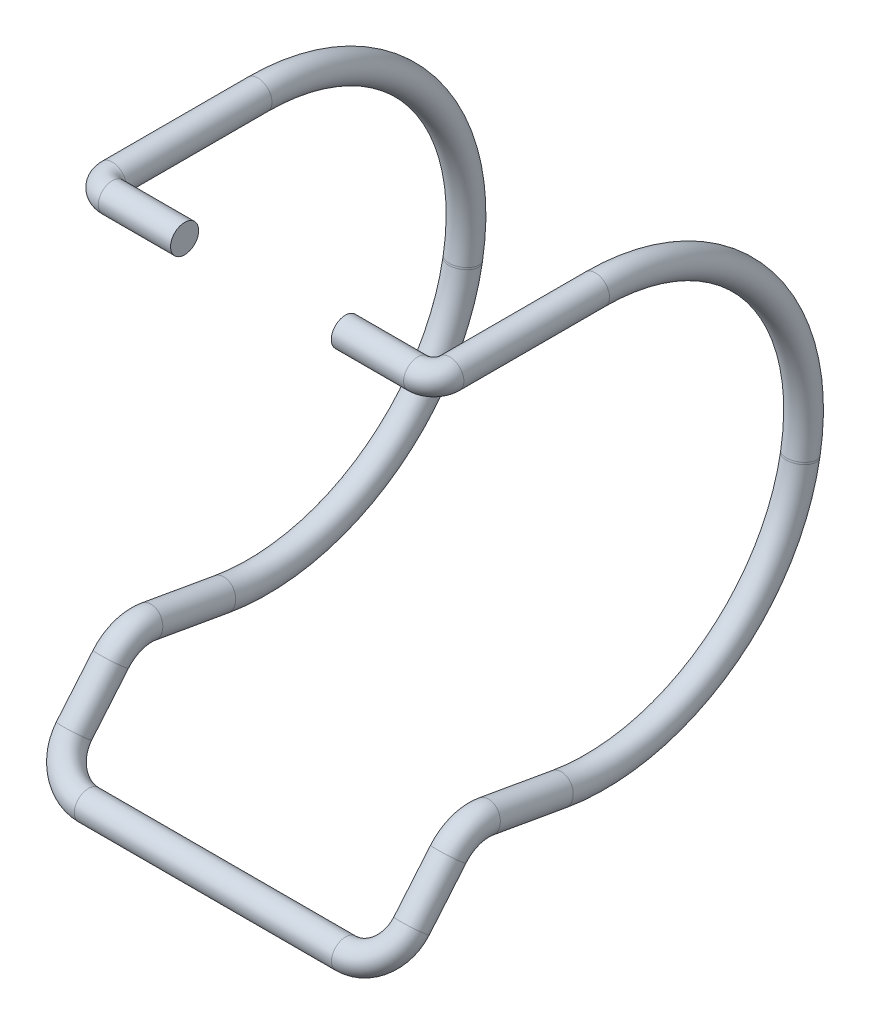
from build123d import *

# Parameters (mm, degrees)
SCHIZZO4_R                    = 1.75
TAGLIO_ESTRUSIONE1_DEPTH      = 83.088437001
TAGLIO_ESTRUSIONE1_DEPTH_BACK = 83.088437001
SCHIZZO5_W                    = 20
SCHIZZO5_H                    = 10


with BuildPart() as part:
    # Sweep2: sweep along a curve in space
    with BuildLine() as sweep2_path:
        Line((-16, -61.011890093, 5.974359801), (16, -61.011890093, 5.974359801))
        ThreePointArc((16, -61.011890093, 5.974359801), (19.535533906, -59.89004398, 5.033019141), (21, -57.181667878, 2.760421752))
        Line((21, -57.181667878, 2.760421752), (21, -51.732603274, -1.811886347))
        ThreePointArc((21, -50.022502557, -6.510349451), (21, -50.248078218, -3.932007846), (21, -51.732603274, -1.811886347))
        Line((21, -50.022502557, -6.510349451), (21, -51.622366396, -15.583628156))
        ThreePointArc((21, -51.622366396, -15.583628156), (21, -47.33188354, -34.936745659), (21, -30.613333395, -45.587636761))
        Line((21, -30.397487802, -45.625696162), (21, -30.613333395, -45.587636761))
        ThreePointArc((21, 0, -20.119175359), (21, -9.251800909, -39.959726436), (21, -30.397487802, -45.625696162))
        Line((21, 0, -2), (21, 0, -20.119175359))
        ThreePointArc((21, 0, -2), (20.414213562, 0, -0.585786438), (19, 0, 0))
        Line((-19, 0, 0), (19, 0, 0))
        ThreePointArc((-19, 0, 0), (-20.414213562, 0, -0.585786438), (-21, 0, -2))
        Line((-21, 0, -20.119175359), (-21, 0, -2))
        ThreePointArc((-21, 0, -20.119175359), (-21, -9.251800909, -39.959726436), (-21, -30.397487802, -45.625696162))
        Line((-21, -30.397487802, -45.625696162), (-21, -30.613333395, -45.587636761))
        ThreePointArc((-21, -51.622366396, -15.583628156), (-21, -47.33188354, -34.936745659), (-21, -30.613333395, -45.587636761))
        Line((-21, -50.022502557, -6.510349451), (-21, -51.622366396, -15.583628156))
        ThreePointArc((-21, -50.022502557, -6.510349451), (-21, -50.248078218, -3.932007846), (-21, -51.732603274, -1.811886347))
        Line((-21, -57.181667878, 2.760421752), (-21, -51.732603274, -1.811886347))
        ThreePointArc((-16, -61.011890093, 5.974359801), (-19.535533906, -59.89004398, 5.033019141), (-21, -57.181667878, 2.760421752))
    # Schizzo4 → Sweep2 (sweep)
    with BuildSketch(Plane(origin=(0, 0, 0), x_dir=(0, 0, -1), z_dir=(1, 0, 0))):
        Circle(SCHIZZO4_R)
    sweep(path=sweep2_path.line)

    # Schizzo5 → Taglio-Estrusione1 (cut, two sides: drawn at the far end of the back side and taken through both)
    with BuildSketch(Plane.XY.offset(-TAGLIO_ESTRUSIONE1_DEPTH_BACK)):
        Rectangle(SCHIZZO5_W, SCHIZZO5_H)
    extrude(amount=TAGLIO_ESTRUSIONE1_DEPTH + TAGLIO_ESTRUSIONE1_DEPTH_BACK, mode=Mode.SUBTRACT)


solid = part.part
